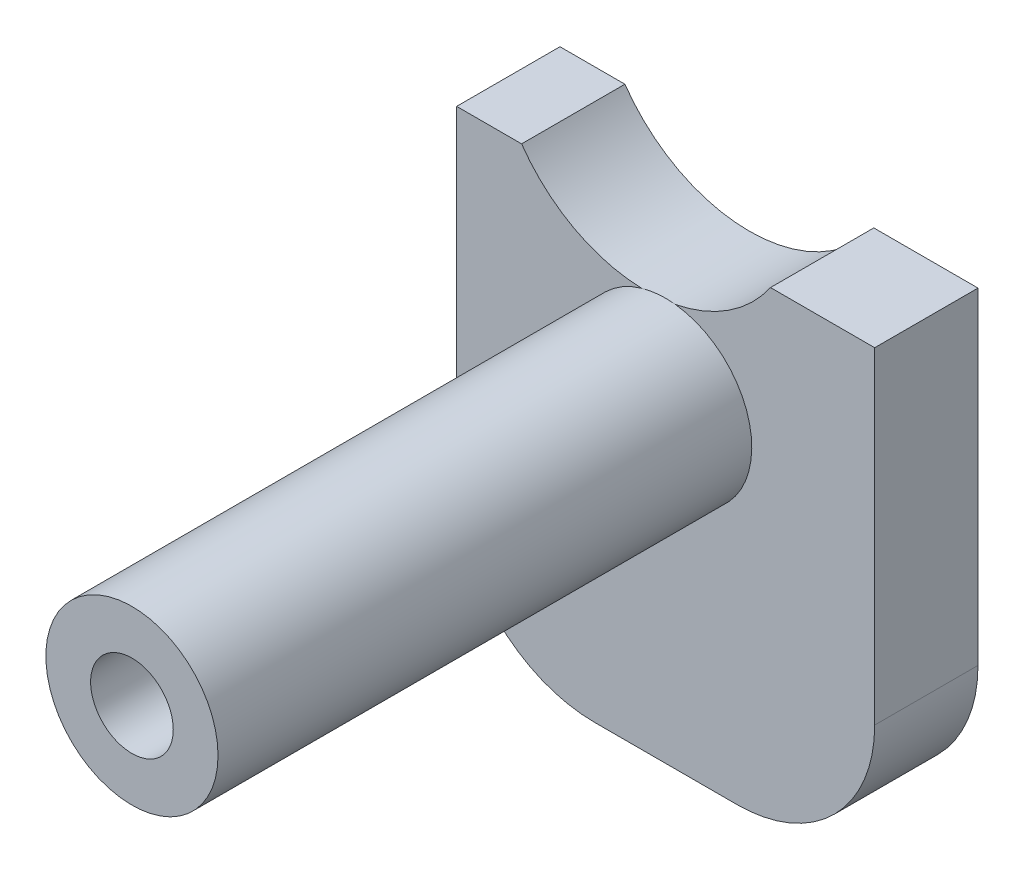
ISO-10303-21;
HEADER;
FILE_DESCRIPTION(('STEP AP214'),'2;1');
FILE_NAME('part.step','',(''),(''),'','','');
FILE_SCHEMA(('AUTOMOTIVE_DESIGN { 1 0 10303 214 1 1 1 1 }'));
ENDSEC;
DATA;
#1=APPLICATION_CONTEXT('core data for automotive mechanical design processes');
#2=APPLICATION_PROTOCOL_DEFINITION('international standard','automotive_design',2000,#1);
#3=PRODUCT_CONTEXT('',#1,'mechanical');
#4=PRODUCT('Part','Part','',(#3));
#5=PRODUCT_RELATED_PRODUCT_CATEGORY('part','',(#4));
#6=PRODUCT_DEFINITION_FORMATION('','',#4);
#7=PRODUCT_DEFINITION_CONTEXT('part definition',#1,'design');
#8=PRODUCT_DEFINITION('design','',#6,#7);
#9=PRODUCT_DEFINITION_SHAPE('','',#8);
#10=(LENGTH_UNIT() NAMED_UNIT(*) SI_UNIT(.MILLI.,.METRE.));
#11=(NAMED_UNIT(*) PLANE_ANGLE_UNIT() SI_UNIT($,.RADIAN.));
#12=(NAMED_UNIT(*) SI_UNIT($,.STERADIAN.) SOLID_ANGLE_UNIT());
#13=UNCERTAINTY_MEASURE_WITH_UNIT(LENGTH_MEASURE(1.E-05),#10,'distance_accuracy_value','');
#14=(GEOMETRIC_REPRESENTATION_CONTEXT(3) GLOBAL_UNCERTAINTY_ASSIGNED_CONTEXT((#13)) GLOBAL_UNIT_ASSIGNED_CONTEXT((#10,
#11,#12)) REPRESENTATION_CONTEXT('',''));
#15=CARTESIAN_POINT('',(0.,0.,0.));
#16=DIRECTION('',(0.,0.,1.));
#17=DIRECTION('',(1.,0.,0.));
#18=AXIS2_PLACEMENT_3D('',#15,#16,#17);
#19=CARTESIAN_POINT('',(-26.5,-16.5920931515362,3.));
#20=DIRECTION('',(0.,0.,1.));
#21=DIRECTION('',(1.,0.,0.));
#22=AXIS2_PLACEMENT_3D('',#19,#20,#21);
#23=PLANE('',#22);
#24=CARTESIAN_POINT('',(-24.43,-11.3920931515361,3.));
#25=DIRECTION('',(0.,0.,1.));
#26=DIRECTION('',(1.,0.,0.));
#27=AXIS2_PLACEMENT_3D('',#24,#25,#26);
#28=CIRCLE('',#27,2.5);
#29=CARTESIAN_POINT('',(-25.1239818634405,-8.99034604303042,3.));
#30=VERTEX_POINT('',#29);
#31=CARTESIAN_POINT('',(-24.1455388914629,-8.90832949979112,3.));
#32=VERTEX_POINT('',#31);
#33=EDGE_CURVE('E11',#30,#32,#28,.T.);
#34=ORIENTED_EDGE('',*,*,#33,.F.);
#35=CARTESIAN_POINT('',(-25.,-4.59209315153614,3.));
#36=DIRECTION('',(0.,0.,-1.));
#37=DIRECTION('',(1.,0.,0.));
#38=AXIS2_PLACEMENT_3D('',#35,#36,#37);
#39=CIRCLE('',#38,4.4);
#40=CARTESIAN_POINT('',(-28.614054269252,-7.10179666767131,3.));
#41=VERTEX_POINT('',#40);
#42=EDGE_CURVE('E105',#30,#41,#39,.T.);
#43=ORIENTED_EDGE('',*,*,#42,.T.);
#44=DIRECTION('',(-1.,0.,0.));
#45=VECTOR('',#44,1.);
#46=CARTESIAN_POINT('',(-30.5,-7.10179666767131,3.));
#47=LINE('',#46,#45);
#48=CARTESIAN_POINT('',(-30.5,-7.10179666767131,3.));
#49=VERTEX_POINT('',#48);
#50=EDGE_CURVE('E102',#41,#49,#47,.T.);
#51=ORIENTED_EDGE('',*,*,#50,.T.);
#52=DIRECTION('',(0.,-1.,0.));
#53=VECTOR('',#52,1.);
#54=CARTESIAN_POINT('',(-30.5,-7.10179666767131,3.));
#55=LINE('',#54,#53);
#56=CARTESIAN_POINT('',(-30.5,-16.5920931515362,3.));
#57=VERTEX_POINT('',#56);
#58=EDGE_CURVE('E48',#49,#57,#55,.T.);
#59=ORIENTED_EDGE('',*,*,#58,.T.);
#60=CARTESIAN_POINT('',(-26.5,-16.5920931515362,3.));
#61=DIRECTION('',(0.,0.,1.));
#62=DIRECTION('',(1.,0.,0.));
#63=AXIS2_PLACEMENT_3D('',#60,#61,#62);
#64=CIRCLE('',#63,4.);
#65=CARTESIAN_POINT('',(-26.5,-20.5920931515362,3.));
#66=VERTEX_POINT('',#65);
#67=EDGE_CURVE('E142',#57,#66,#64,.T.);
#68=ORIENTED_EDGE('',*,*,#67,.T.);
#69=DIRECTION('',(1.,0.,0.));
#70=VECTOR('',#69,1.);
#71=CARTESIAN_POINT('',(-26.5,-20.5920931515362,3.));
#72=LINE('',#71,#70);
#73=CARTESIAN_POINT('',(-22.36,-20.5920931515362,3.));
#74=VERTEX_POINT('',#73);
#75=EDGE_CURVE('E144',#66,#74,#72,.T.);
#76=ORIENTED_EDGE('',*,*,#75,.T.);
#77=CARTESIAN_POINT('',(-22.36,-16.5920931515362,3.));
#78=DIRECTION('',(0.,0.,1.));
#79=DIRECTION('',(-1.,0.,0.));
#80=AXIS2_PLACEMENT_3D('',#77,#78,#79);
#81=CIRCLE('',#80,4.);
#82=CARTESIAN_POINT('',(-18.36,-16.5920931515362,3.));
#83=VERTEX_POINT('',#82);
#84=EDGE_CURVE('E146',#74,#83,#81,.T.);
#85=ORIENTED_EDGE('',*,*,#84,.T.);
#86=DIRECTION('',(0.,1.,0.));
#87=VECTOR('',#86,1.);
#88=CARTESIAN_POINT('',(-18.36,-7.10179666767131,3.));
#89=LINE('',#88,#87);
#90=CARTESIAN_POINT('',(-18.36,-7.10179666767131,3.));
#91=VERTEX_POINT('',#90);
#92=EDGE_CURVE('E148',#83,#91,#89,.T.);
#93=ORIENTED_EDGE('',*,*,#92,.T.);
#94=DIRECTION('',(-1.,0.,0.));
#95=VECTOR('',#94,1.);
#96=CARTESIAN_POINT('',(-21.385945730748,-7.10179666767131,3.));
#97=LINE('',#96,#95);
#98=CARTESIAN_POINT('',(-21.385945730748,-7.10179666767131,3.));
#99=VERTEX_POINT('',#98);
#100=EDGE_CURVE('E98',#91,#99,#97,.T.);
#101=ORIENTED_EDGE('',*,*,#100,.T.);
#102=EDGE_CURVE('E95',#99,#32,#39,.T.);
#103=ORIENTED_EDGE('',*,*,#102,.T.);
#104=EDGE_LOOP('',(#34,#43,#51,#59,#68,#76,#85,#93,#101,#103));
#105=FACE_BOUND('',#104,.T.);
#106=ADVANCED_FACE('F26',(#105),#23,.T.);
#107=CARTESIAN_POINT('',(-26.5,-16.5920931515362,0.));
#108=DIRECTION('',(0.,0.,1.));
#109=DIRECTION('',(1.,0.,0.));
#110=AXIS2_PLACEMENT_3D('',#107,#108,#109);
#111=PLANE('',#110);
#112=CARTESIAN_POINT('',(-26.5,-16.5920931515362,0.));
#113=DIRECTION('',(0.,0.,1.));
#114=DIRECTION('',(1.,0.,0.));
#115=AXIS2_PLACEMENT_3D('',#112,#113,#114);
#116=CIRCLE('',#115,4.);
#117=CARTESIAN_POINT('',(-30.5,-16.5920931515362,0.));
#118=VERTEX_POINT('',#117);
#119=CARTESIAN_POINT('',(-26.5,-20.5920931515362,0.));
#120=VERTEX_POINT('',#119);
#121=EDGE_CURVE('E125',#118,#120,#116,.T.);
#122=ORIENTED_EDGE('',*,*,#121,.F.);
#123=DIRECTION('',(0.,-1.,0.));
#124=VECTOR('',#123,1.);
#125=CARTESIAN_POINT('',(-30.5,-7.10179666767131,0.));
#126=LINE('',#125,#124);
#127=CARTESIAN_POINT('',(-30.5,-7.10179666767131,0.));
#128=VERTEX_POINT('',#127);
#129=EDGE_CURVE('E140',#128,#118,#126,.T.);
#130=ORIENTED_EDGE('',*,*,#129,.F.);
#131=DIRECTION('',(-1.,0.,0.));
#132=VECTOR('',#131,1.);
#133=CARTESIAN_POINT('',(-30.5,-7.10179666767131,0.));
#134=LINE('',#133,#132);
#135=CARTESIAN_POINT('',(-28.614054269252,-7.10179666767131,0.));
#136=VERTEX_POINT('',#135);
#137=EDGE_CURVE('E138',#136,#128,#134,.T.);
#138=ORIENTED_EDGE('',*,*,#137,.F.);
#139=CARTESIAN_POINT('',(-25.,-4.59209315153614,0.));
#140=DIRECTION('',(0.,0.,-1.));
#141=DIRECTION('',(1.,0.,0.));
#142=AXIS2_PLACEMENT_3D('',#139,#140,#141);
#143=CIRCLE('',#142,4.4);
#144=CARTESIAN_POINT('',(-21.385945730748,-7.10179666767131,0.));
#145=VERTEX_POINT('',#144);
#146=EDGE_CURVE('E136',#145,#136,#143,.T.);
#147=ORIENTED_EDGE('',*,*,#146,.F.);
#148=DIRECTION('',(-1.,0.,0.));
#149=VECTOR('',#148,1.);
#150=CARTESIAN_POINT('',(-21.385945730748,-7.10179666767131,0.));
#151=LINE('',#150,#149);
#152=CARTESIAN_POINT('',(-18.36,-7.10179666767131,0.));
#153=VERTEX_POINT('',#152);
#154=EDGE_CURVE('E134',#153,#145,#151,.T.);
#155=ORIENTED_EDGE('',*,*,#154,.F.);
#156=DIRECTION('',(0.,1.,0.));
#157=VECTOR('',#156,1.);
#158=CARTESIAN_POINT('',(-18.36,-7.10179666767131,0.));
#159=LINE('',#158,#157);
#160=CARTESIAN_POINT('',(-18.36,-16.5920931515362,0.));
#161=VERTEX_POINT('',#160);
#162=EDGE_CURVE('E132',#161,#153,#159,.T.);
#163=ORIENTED_EDGE('',*,*,#162,.F.);
#164=CARTESIAN_POINT('',(-22.36,-16.5920931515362,0.));
#165=DIRECTION('',(0.,0.,1.));
#166=DIRECTION('',(-1.,0.,0.));
#167=AXIS2_PLACEMENT_3D('',#164,#165,#166);
#168=CIRCLE('',#167,4.);
#169=CARTESIAN_POINT('',(-22.36,-20.5920931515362,0.));
#170=VERTEX_POINT('',#169);
#171=EDGE_CURVE('E130',#170,#161,#168,.T.);
#172=ORIENTED_EDGE('',*,*,#171,.F.);
#173=DIRECTION('',(1.,0.,0.));
#174=VECTOR('',#173,1.);
#175=CARTESIAN_POINT('',(-26.5,-20.5920931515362,0.));
#176=LINE('',#175,#174);
#177=EDGE_CURVE('E128',#120,#170,#176,.T.);
#178=ORIENTED_EDGE('',*,*,#177,.F.);
#179=EDGE_LOOP('',(#122,#130,#138,#147,#155,#163,#172,#178));
#180=FACE_BOUND('',#179,.T.);
#181=CARTESIAN_POINT('',(-24.43,-11.3920931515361,0.));
#182=DIRECTION('',(0.,0.,1.));
#183=DIRECTION('',(1.,0.,0.));
#184=AXIS2_PLACEMENT_3D('',#181,#182,#183);
#185=CIRCLE('',#184,1.2);
#186=CARTESIAN_POINT('',(-23.23,-11.3920931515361,0.));
#187=VERTEX_POINT('',#186);
#188=EDGE_CURVE('E118',#187,#187,#185,.T.);
#189=ORIENTED_EDGE('',*,*,#188,.T.);
#190=EDGE_LOOP('',(#189));
#191=FACE_BOUND('',#190,.T.);
#192=ADVANCED_FACE('F184',(#180,#191),#111,.F.);
#193=CARTESIAN_POINT('',(-26.5,-16.5920931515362,3.));
#194=DIRECTION('',(0.,0.,-1.));
#195=DIRECTION('',(-1.,0.,0.));
#196=AXIS2_PLACEMENT_3D('',#193,#194,#195);
#197=CYLINDRICAL_SURFACE('',#196,4.);
#198=ORIENTED_EDGE('',*,*,#121,.T.);
#199=DIRECTION('',(0.,0.,-1.));
#200=VECTOR('',#199,1.);
#201=CARTESIAN_POINT('',(-26.5,-20.5920931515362,3.));
#202=LINE('',#201,#200);
#203=EDGE_CURVE('E30',#66,#120,#202,.T.);
#204=ORIENTED_EDGE('',*,*,#203,.F.);
#205=ORIENTED_EDGE('',*,*,#67,.F.);
#206=DIRECTION('',(0.,0.,-1.));
#207=VECTOR('',#206,1.);
#208=CARTESIAN_POINT('',(-30.5,-16.5920931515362,3.));
#209=LINE('',#208,#207);
#210=EDGE_CURVE('E153',#57,#118,#209,.T.);
#211=ORIENTED_EDGE('',*,*,#210,.T.);
#212=EDGE_LOOP('',(#198,#204,#205,#211));
#213=FACE_BOUND('',#212,.T.);
#214=ADVANCED_FACE('F28',(#213),#197,.T.);
#215=CARTESIAN_POINT('',(-26.5,-20.5920931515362,3.));
#216=DIRECTION('',(0.,1.,0.));
#217=DIRECTION('',(0.,0.,1.));
#218=AXIS2_PLACEMENT_3D('',#215,#216,#217);
#219=PLANE('',#218);
#220=ORIENTED_EDGE('',*,*,#177,.T.);
#221=DIRECTION('',(0.,0.,-1.));
#222=VECTOR('',#221,1.);
#223=CARTESIAN_POINT('',(-22.36,-20.5920931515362,3.));
#224=LINE('',#223,#222);
#225=EDGE_CURVE('E169',#74,#170,#224,.T.);
#226=ORIENTED_EDGE('',*,*,#225,.F.);
#227=ORIENTED_EDGE('',*,*,#75,.F.);
#228=ORIENTED_EDGE('',*,*,#203,.T.);
#229=EDGE_LOOP('',(#220,#226,#227,#228));
#230=FACE_BOUND('',#229,.T.);
#231=ADVANCED_FACE('F178',(#230),#219,.F.);
#232=CARTESIAN_POINT('',(-22.36,-16.5920931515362,3.));
#233=DIRECTION('',(0.,0.,-1.));
#234=DIRECTION('',(-1.,0.,0.));
#235=AXIS2_PLACEMENT_3D('',#232,#233,#234);
#236=CYLINDRICAL_SURFACE('',#235,4.);
#237=ORIENTED_EDGE('',*,*,#171,.T.);
#238=DIRECTION('',(0.,0.,-1.));
#239=VECTOR('',#238,1.);
#240=CARTESIAN_POINT('',(-18.36,-16.5920931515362,3.));
#241=LINE('',#240,#239);
#242=EDGE_CURVE('E167',#83,#161,#241,.T.);
#243=ORIENTED_EDGE('',*,*,#242,.F.);
#244=ORIENTED_EDGE('',*,*,#84,.F.);
#245=ORIENTED_EDGE('',*,*,#225,.T.);
#246=EDGE_LOOP('',(#237,#243,#244,#245));
#247=FACE_BOUND('',#246,.T.);
#248=ADVANCED_FACE('F190',(#247),#236,.T.);
#249=CARTESIAN_POINT('',(-18.36,-7.10179666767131,3.));
#250=DIRECTION('',(-1.,0.,0.));
#251=DIRECTION('',(0.,-1.,0.));
#252=AXIS2_PLACEMENT_3D('',#249,#250,#251);
#253=PLANE('',#252);
#254=ORIENTED_EDGE('',*,*,#162,.T.);
#255=DIRECTION('',(0.,0.,-1.));
#256=VECTOR('',#255,1.);
#257=CARTESIAN_POINT('',(-18.36,-7.10179666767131,3.));
#258=LINE('',#257,#256);
#259=EDGE_CURVE('E164',#91,#153,#258,.T.);
#260=ORIENTED_EDGE('',*,*,#259,.F.);
#261=ORIENTED_EDGE('',*,*,#92,.F.);
#262=ORIENTED_EDGE('',*,*,#242,.T.);
#263=EDGE_LOOP('',(#254,#260,#261,#262));
#264=FACE_BOUND('',#263,.T.);
#265=ADVANCED_FACE('F193',(#264),#253,.F.);
#266=CARTESIAN_POINT('',(-21.385945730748,-7.10179666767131,3.));
#267=DIRECTION('',(0.,-1.,0.));
#268=DIRECTION('',(0.,0.,-1.));
#269=AXIS2_PLACEMENT_3D('',#266,#267,#268);
#270=PLANE('',#269);
#271=ORIENTED_EDGE('',*,*,#154,.T.);
#272=DIRECTION('',(0.,0.,-1.));
#273=VECTOR('',#272,1.);
#274=CARTESIAN_POINT('',(-21.385945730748,-7.10179666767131,3.));
#275=LINE('',#274,#273);
#276=EDGE_CURVE('E162',#99,#145,#275,.T.);
#277=ORIENTED_EDGE('',*,*,#276,.F.);
#278=ORIENTED_EDGE('',*,*,#100,.F.);
#279=ORIENTED_EDGE('',*,*,#259,.T.);
#280=EDGE_LOOP('',(#271,#277,#278,#279));
#281=FACE_BOUND('',#280,.T.);
#282=ADVANCED_FACE('F196',(#281),#270,.F.);
#283=CARTESIAN_POINT('',(-25.,-4.59209315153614,3.));
#284=DIRECTION('',(0.,0.,-1.));
#285=DIRECTION('',(-1.,0.,0.));
#286=AXIS2_PLACEMENT_3D('',#283,#284,#285);
#287=CYLINDRICAL_SURFACE('',#286,4.4);
#288=ORIENTED_EDGE('',*,*,#146,.T.);
#289=DIRECTION('',(0.,0.,-1.));
#290=VECTOR('',#289,1.);
#291=CARTESIAN_POINT('',(-28.614054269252,-7.10179666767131,3.));
#292=LINE('',#291,#290);
#293=EDGE_CURVE('E159',#41,#136,#292,.T.);
#294=ORIENTED_EDGE('',*,*,#293,.F.);
#295=ORIENTED_EDGE('',*,*,#42,.F.);
#296=EDGE_CURVE('E103',#32,#30,#39,.T.);
#297=ORIENTED_EDGE('',*,*,#296,.F.);
#298=ORIENTED_EDGE('',*,*,#102,.F.);
#299=ORIENTED_EDGE('',*,*,#276,.T.);
#300=EDGE_LOOP('',(#288,#294,#295,#297,#298,#299));
#301=FACE_BOUND('',#300,.T.);
#302=ADVANCED_FACE('F107',(#301),#287,.F.);
#303=CARTESIAN_POINT('',(-30.5,-7.10179666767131,3.));
#304=DIRECTION('',(0.,-1.,0.));
#305=DIRECTION('',(0.,0.,-1.));
#306=AXIS2_PLACEMENT_3D('',#303,#304,#305);
#307=PLANE('',#306);
#308=ORIENTED_EDGE('',*,*,#137,.T.);
#309=DIRECTION('',(0.,0.,-1.));
#310=VECTOR('',#309,1.);
#311=CARTESIAN_POINT('',(-30.5,-7.10179666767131,3.));
#312=LINE('',#311,#310);
#313=EDGE_CURVE('E156',#49,#128,#312,.T.);
#314=ORIENTED_EDGE('',*,*,#313,.F.);
#315=ORIENTED_EDGE('',*,*,#50,.F.);
#316=ORIENTED_EDGE('',*,*,#293,.T.);
#317=EDGE_LOOP('',(#308,#314,#315,#316));
#318=FACE_BOUND('',#317,.T.);
#319=ADVANCED_FACE('F200',(#318),#307,.F.);
#320=CARTESIAN_POINT('',(-30.5,-7.10179666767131,3.));
#321=DIRECTION('',(1.,0.,0.));
#322=DIRECTION('',(0.,0.,-1.));
#323=AXIS2_PLACEMENT_3D('',#320,#321,#322);
#324=PLANE('',#323);
#325=ORIENTED_EDGE('',*,*,#129,.T.);
#326=ORIENTED_EDGE('',*,*,#210,.F.);
#327=ORIENTED_EDGE('',*,*,#58,.F.);
#328=ORIENTED_EDGE('',*,*,#313,.T.);
#329=EDGE_LOOP('',(#325,#326,#327,#328));
#330=FACE_BOUND('',#329,.T.);
#331=ADVANCED_FACE('F203',(#330),#324,.F.);
#332=CARTESIAN_POINT('',(-24.43,-11.3920931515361,3.));
#333=DIRECTION('',(0.,0.,-1.));
#334=DIRECTION('',(-1.,0.,0.));
#335=AXIS2_PLACEMENT_3D('',#332,#333,#334);
#336=CYLINDRICAL_SURFACE('',#335,1.2);
#337=ORIENTED_EDGE('',*,*,#188,.F.);
#338=EDGE_LOOP('',(#337));
#339=FACE_BOUND('',#338,.T.);
#340=CARTESIAN_POINT('',(-24.43,-11.3920931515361,18.5));
#341=DIRECTION('',(0.,0.,1.));
#342=DIRECTION('',(1.,0.,0.));
#343=AXIS2_PLACEMENT_3D('',#340,#341,#342);
#344=CIRCLE('',#343,1.2);
#345=CARTESIAN_POINT('',(-23.23,-11.3920931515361,18.5));
#346=VERTEX_POINT('',#345);
#347=EDGE_CURVE('E116',#346,#346,#344,.T.);
#348=ORIENTED_EDGE('',*,*,#347,.T.);
#349=EDGE_LOOP('',(#348));
#350=FACE_BOUND('',#349,.T.);
#351=ADVANCED_FACE('F205',(#339,#350),#336,.F.);
#352=CARTESIAN_POINT('',(-24.43,-11.3920931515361,3.));
#353=DIRECTION('',(0.,0.,1.));
#354=DIRECTION('',(1.,0.,0.));
#355=AXIS2_PLACEMENT_3D('',#352,#353,#354);
#356=PLANE('',#355);
#357=EDGE_CURVE('E36',#32,#30,#28,.T.);
#358=ORIENTED_EDGE('',*,*,#357,.F.);
#359=ORIENTED_EDGE('',*,*,#296,.T.);
#360=EDGE_LOOP('',(#358,#359));
#361=FACE_BOUND('',#360,.T.);
#362=ADVANCED_FACE('F114',(#361),#356,.F.);
#363=CARTESIAN_POINT('',(-24.43,-11.3920931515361,18.5));
#364=DIRECTION('',(0.,0.,1.));
#365=DIRECTION('',(1.,0.,0.));
#366=AXIS2_PLACEMENT_3D('',#363,#364,#365);
#367=PLANE('',#366);
#368=CARTESIAN_POINT('',(-24.43,-11.3920931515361,18.5));
#369=DIRECTION('',(0.,0.,1.));
#370=DIRECTION('',(1.,0.,0.));
#371=AXIS2_PLACEMENT_3D('',#368,#369,#370);
#372=CIRCLE('',#371,2.5);
#373=CARTESIAN_POINT('',(-21.93,-11.3920931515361,18.5));
#374=VERTEX_POINT('',#373);
#375=EDGE_CURVE('E115',#374,#374,#372,.T.);
#376=ORIENTED_EDGE('',*,*,#375,.T.);
#377=EDGE_LOOP('',(#376));
#378=FACE_BOUND('',#377,.T.);
#379=ORIENTED_EDGE('',*,*,#347,.F.);
#380=EDGE_LOOP('',(#379));
#381=FACE_BOUND('',#380,.T.);
#382=ADVANCED_FACE('F224',(#378,#381),#367,.T.);
#383=CARTESIAN_POINT('',(-24.43,-11.3920931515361,18.5));
#384=DIRECTION('',(0.,0.,-1.));
#385=DIRECTION('',(-1.,0.,0.));
#386=AXIS2_PLACEMENT_3D('',#383,#384,#385);
#387=CYLINDRICAL_SURFACE('',#386,2.5);
#388=ORIENTED_EDGE('',*,*,#375,.F.);
#389=EDGE_LOOP('',(#388));
#390=FACE_BOUND('',#389,.T.);
#391=ORIENTED_EDGE('',*,*,#357,.T.);
#392=ORIENTED_EDGE('',*,*,#33,.T.);
#393=EDGE_LOOP('',(#391,#392));
#394=FACE_BOUND('',#393,.T.);
#395=ADVANCED_FACE('F113',(#390,#394),#387,.T.);
#396=CLOSED_SHELL('',(#106,#192,#214,#231,#248,#265,#282,#302,#319,#331,#351,#362,#382,#395));
#397=MANIFOLD_SOLID_BREP('B2',#396);
#398=ADVANCED_BREP_SHAPE_REPRESENTATION('',(#18,#397),#14);
#399=SHAPE_DEFINITION_REPRESENTATION(#9,#398);
ENDSEC;
END-ISO-10303-21;
